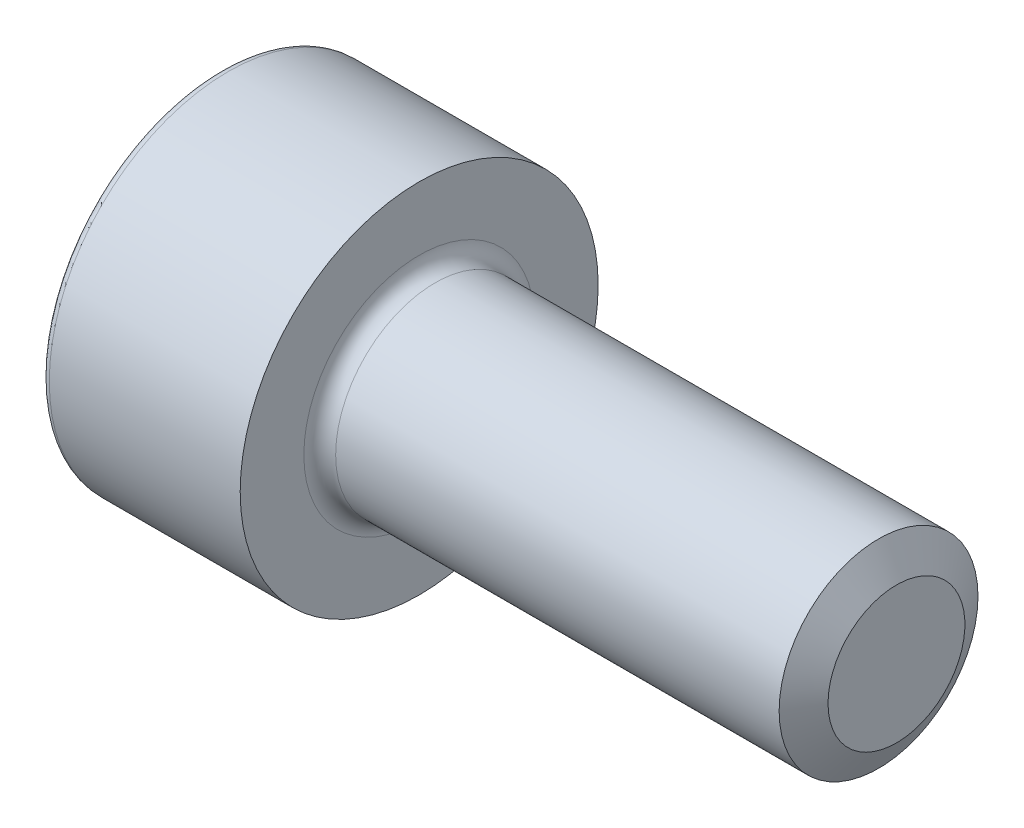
ISO-10303-21;
HEADER;
FILE_DESCRIPTION(('STEP AP214'),'2;1');
FILE_NAME('part.step','',(''),(''),'','','');
FILE_SCHEMA(('AUTOMOTIVE_DESIGN { 1 0 10303 214 1 1 1 1 }'));
ENDSEC;
DATA;
#1=APPLICATION_CONTEXT('core data for automotive mechanical design processes');
#2=APPLICATION_PROTOCOL_DEFINITION('international standard','automotive_design',2000,#1);
#3=PRODUCT_CONTEXT('',#1,'mechanical');
#4=PRODUCT('Part','Part','',(#3));
#5=PRODUCT_RELATED_PRODUCT_CATEGORY('part','',(#4));
#6=PRODUCT_DEFINITION_FORMATION('','',#4);
#7=PRODUCT_DEFINITION_CONTEXT('part definition',#1,'design');
#8=PRODUCT_DEFINITION('design','',#6,#7);
#9=PRODUCT_DEFINITION_SHAPE('','',#8);
#10=(LENGTH_UNIT() NAMED_UNIT(*) SI_UNIT(.MILLI.,.METRE.));
#11=(NAMED_UNIT(*) PLANE_ANGLE_UNIT() SI_UNIT($,.RADIAN.));
#12=(NAMED_UNIT(*) SI_UNIT($,.STERADIAN.) SOLID_ANGLE_UNIT());
#13=UNCERTAINTY_MEASURE_WITH_UNIT(LENGTH_MEASURE(1.E-05),#10,'distance_accuracy_value','');
#14=(GEOMETRIC_REPRESENTATION_CONTEXT(3) GLOBAL_UNCERTAINTY_ASSIGNED_CONTEXT((#13)) GLOBAL_UNIT_ASSIGNED_CONTEXT((#10,
#11,#12)) REPRESENTATION_CONTEXT('',''));
#15=CARTESIAN_POINT('',(0.,0.,0.));
#16=DIRECTION('',(0.,0.,1.));
#17=DIRECTION('',(1.,0.,0.));
#18=AXIS2_PLACEMENT_3D('',#15,#16,#17);
#19=CARTESIAN_POINT('',(8.5,1.25,0.));
#20=DIRECTION('',(-1.,0.,0.));
#21=DIRECTION('',(0.,0.,1.));
#22=AXIS2_PLACEMENT_3D('',#19,#20,#21);
#23=PLANE('',#22);
#24=CARTESIAN_POINT('',(8.5,0.,0.));
#25=DIRECTION('',(-1.,0.,0.));
#26=DIRECTION('',(0.,0.,1.));
#27=AXIS2_PLACEMENT_3D('',#24,#25,#26);
#28=CIRCLE('',#27,0.8603);
#29=CARTESIAN_POINT('',(8.5,0.,0.8603));
#30=VERTEX_POINT('',#29);
#31=EDGE_CURVE('E186',#30,#30,#28,.T.);
#32=ORIENTED_EDGE('',*,*,#31,.F.);
#33=EDGE_LOOP('',(#32));
#34=FACE_BOUND('',#33,.T.);
#35=ADVANCED_FACE('F17',(#34),#23,.F.);
#36=CARTESIAN_POINT('',(1.1,-0.995929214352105,0.575));
#37=DIRECTION('',(1.,0.,0.));
#38=DIRECTION('',(0.,1.,0.));
#39=AXIS2_PLACEMENT_3D('',#36,#37,#38);
#40=PLANE('',#39);
#41=DIRECTION('',(0.,0.866025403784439,0.5));
#42=VECTOR('',#41,1.);
#43=CARTESIAN_POINT('',(1.1,-0.995929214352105,0.575));
#44=LINE('',#43,#42);
#45=CARTESIAN_POINT('',(1.1,-0.995929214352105,0.575));
#46=VERTEX_POINT('',#45);
#47=CARTESIAN_POINT('',(1.1,0.,1.15));
#48=VERTEX_POINT('',#47);
#49=EDGE_CURVE('E93',#46,#48,#44,.T.);
#50=ORIENTED_EDGE('',*,*,#49,.T.);
#51=DIRECTION('',(0.,0.866025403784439,-0.5));
#52=VECTOR('',#51,1.);
#53=CARTESIAN_POINT('',(1.1,0.,1.15));
#54=LINE('',#53,#52);
#55=CARTESIAN_POINT('',(1.1,0.995929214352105,0.575));
#56=VERTEX_POINT('',#55);
#57=EDGE_CURVE('E11',#48,#56,#54,.T.);
#58=ORIENTED_EDGE('',*,*,#57,.T.);
#59=DIRECTION('',(0.,0.,-1.));
#60=VECTOR('',#59,1.);
#61=CARTESIAN_POINT('',(1.1,0.995929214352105,0.575));
#62=LINE('',#61,#60);
#63=CARTESIAN_POINT('',(1.1,0.995929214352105,-0.575));
#64=VERTEX_POINT('',#63);
#65=EDGE_CURVE('E45',#56,#64,#62,.T.);
#66=ORIENTED_EDGE('',*,*,#65,.T.);
#67=DIRECTION('',(0.,-0.866025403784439,-0.5));
#68=VECTOR('',#67,1.);
#69=CARTESIAN_POINT('',(1.1,0.995929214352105,-0.575));
#70=LINE('',#69,#68);
#71=CARTESIAN_POINT('',(1.1,0.,-1.15));
#72=VERTEX_POINT('',#71);
#73=EDGE_CURVE('E130',#64,#72,#70,.T.);
#74=ORIENTED_EDGE('',*,*,#73,.T.);
#75=DIRECTION('',(0.,-0.866025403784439,0.5));
#76=VECTOR('',#75,1.);
#77=CARTESIAN_POINT('',(1.1,0.,-1.15));
#78=LINE('',#77,#76);
#79=CARTESIAN_POINT('',(1.1,-0.995929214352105,-0.575));
#80=VERTEX_POINT('',#79);
#81=EDGE_CURVE('E125',#72,#80,#78,.T.);
#82=ORIENTED_EDGE('',*,*,#81,.T.);
#83=DIRECTION('',(0.,0.,1.));
#84=VECTOR('',#83,1.);
#85=CARTESIAN_POINT('',(1.1,-0.995929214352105,-0.575));
#86=LINE('',#85,#84);
#87=EDGE_CURVE('E96',#80,#46,#86,.T.);
#88=ORIENTED_EDGE('',*,*,#87,.T.);
#89=EDGE_LOOP('',(#50,#58,#66,#74,#82,#88));
#90=FACE_BOUND('',#89,.T.);
#91=ADVANCED_FACE('F94',(#90),#40,.F.);
#92=CARTESIAN_POINT('',(1.1,0.,1.15));
#93=DIRECTION('',(0.,0.5,0.866025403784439));
#94=DIRECTION('',(1.,0.,0.));
#95=AXIS2_PLACEMENT_3D('',#92,#93,#94);
#96=PLANE('',#95);
#97=DIRECTION('',(0.,0.866025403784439,-0.5));
#98=VECTOR('',#97,1.);
#99=CARTESIAN_POINT('',(0.,0.,1.15));
#100=LINE('',#99,#98);
#101=CARTESIAN_POINT('',(0.,0.,1.15));
#102=VERTEX_POINT('',#101);
#103=CARTESIAN_POINT('',(0.,0.995929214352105,0.575));
#104=VERTEX_POINT('',#103);
#105=EDGE_CURVE('E165',#102,#104,#100,.T.);
#106=ORIENTED_EDGE('',*,*,#105,.T.);
#107=DIRECTION('',(-1.,0.,0.));
#108=VECTOR('',#107,1.);
#109=CARTESIAN_POINT('',(1.1,0.995929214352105,0.575));
#110=LINE('',#109,#108);
#111=EDGE_CURVE('E20',#56,#104,#110,.T.);
#112=ORIENTED_EDGE('',*,*,#111,.F.);
#113=ORIENTED_EDGE('',*,*,#57,.F.);
#114=DIRECTION('',(-1.,0.,0.));
#115=VECTOR('',#114,1.);
#116=CARTESIAN_POINT('',(1.1,0.,1.15));
#117=LINE('',#116,#115);
#118=EDGE_CURVE('E90',#48,#102,#117,.T.);
#119=ORIENTED_EDGE('',*,*,#118,.T.);
#120=EDGE_LOOP('',(#106,#112,#113,#119));
#121=FACE_BOUND('',#120,.T.);
#122=ADVANCED_FACE('F88',(#121),#96,.F.);
#123=CARTESIAN_POINT('',(1.1,0.995929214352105,0.575));
#124=DIRECTION('',(0.,1.,0.));
#125=DIRECTION('',(0.,0.,-1.));
#126=AXIS2_PLACEMENT_3D('',#123,#124,#125);
#127=PLANE('',#126);
#128=DIRECTION('',(0.,0.,-1.));
#129=VECTOR('',#128,1.);
#130=CARTESIAN_POINT('',(0.,0.995929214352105,0.575));
#131=LINE('',#130,#129);
#132=CARTESIAN_POINT('',(0.,0.995929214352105,-0.575));
#133=VERTEX_POINT('',#132);
#134=EDGE_CURVE('E107',#104,#133,#131,.T.);
#135=ORIENTED_EDGE('',*,*,#134,.T.);
#136=DIRECTION('',(-1.,0.,0.));
#137=VECTOR('',#136,1.);
#138=CARTESIAN_POINT('',(1.1,0.995929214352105,-0.575));
#139=LINE('',#138,#137);
#140=EDGE_CURVE('E118',#64,#133,#139,.T.);
#141=ORIENTED_EDGE('',*,*,#140,.F.);
#142=ORIENTED_EDGE('',*,*,#65,.F.);
#143=ORIENTED_EDGE('',*,*,#111,.T.);
#144=EDGE_LOOP('',(#135,#141,#142,#143));
#145=FACE_BOUND('',#144,.T.);
#146=ADVANCED_FACE('F146',(#145),#127,.F.);
#147=CARTESIAN_POINT('',(1.1,0.995929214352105,-0.575));
#148=DIRECTION('',(0.,0.5,-0.866025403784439));
#149=DIRECTION('',(-1.,0.,0.));
#150=AXIS2_PLACEMENT_3D('',#147,#148,#149);
#151=PLANE('',#150);
#152=DIRECTION('',(0.,-0.866025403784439,-0.5));
#153=VECTOR('',#152,1.);
#154=CARTESIAN_POINT('',(0.,0.995929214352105,-0.575));
#155=LINE('',#154,#153);
#156=CARTESIAN_POINT('',(0.,0.,-1.15));
#157=VERTEX_POINT('',#156);
#158=EDGE_CURVE('E114',#133,#157,#155,.T.);
#159=ORIENTED_EDGE('',*,*,#158,.T.);
#160=DIRECTION('',(-1.,0.,0.));
#161=VECTOR('',#160,1.);
#162=CARTESIAN_POINT('',(1.1,0.,-1.15));
#163=LINE('',#162,#161);
#164=EDGE_CURVE('E128',#72,#157,#163,.T.);
#165=ORIENTED_EDGE('',*,*,#164,.F.);
#166=ORIENTED_EDGE('',*,*,#73,.F.);
#167=ORIENTED_EDGE('',*,*,#140,.T.);
#168=EDGE_LOOP('',(#159,#165,#166,#167));
#169=FACE_BOUND('',#168,.T.);
#170=ADVANCED_FACE('F140',(#169),#151,.F.);
#171=CARTESIAN_POINT('',(1.1,0.,-1.15));
#172=DIRECTION('',(0.,-0.5,-0.866025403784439));
#173=DIRECTION('',(0.,-0.866025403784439,0.5));
#174=AXIS2_PLACEMENT_3D('',#171,#172,#173);
#175=PLANE('',#174);
#176=DIRECTION('',(0.,-0.866025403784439,0.5));
#177=VECTOR('',#176,1.);
#178=CARTESIAN_POINT('',(0.,0.,-1.15));
#179=LINE('',#178,#177);
#180=CARTESIAN_POINT('',(0.,-0.995929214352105,-0.575));
#181=VERTEX_POINT('',#180);
#182=EDGE_CURVE('E152',#157,#181,#179,.T.);
#183=ORIENTED_EDGE('',*,*,#182,.T.);
#184=DIRECTION('',(-1.,0.,0.));
#185=VECTOR('',#184,1.);
#186=CARTESIAN_POINT('',(1.1,-0.995929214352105,-0.575));
#187=LINE('',#186,#185);
#188=EDGE_CURVE('E122',#80,#181,#187,.T.);
#189=ORIENTED_EDGE('',*,*,#188,.F.);
#190=ORIENTED_EDGE('',*,*,#81,.F.);
#191=ORIENTED_EDGE('',*,*,#164,.T.);
#192=EDGE_LOOP('',(#183,#189,#190,#191));
#193=FACE_BOUND('',#192,.T.);
#194=ADVANCED_FACE('F228',(#193),#175,.F.);
#195=CARTESIAN_POINT('',(1.1,-0.995929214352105,-0.575));
#196=DIRECTION('',(0.,-1.,0.));
#197=DIRECTION('',(0.,0.,-1.));
#198=AXIS2_PLACEMENT_3D('',#195,#196,#197);
#199=PLANE('',#198);
#200=DIRECTION('',(0.,0.,1.));
#201=VECTOR('',#200,1.);
#202=CARTESIAN_POINT('',(0.,-0.995929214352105,-0.575));
#203=LINE('',#202,#201);
#204=CARTESIAN_POINT('',(0.,-0.995929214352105,0.575));
#205=VERTEX_POINT('',#204);
#206=EDGE_CURVE('E157',#181,#205,#203,.T.);
#207=ORIENTED_EDGE('',*,*,#206,.T.);
#208=DIRECTION('',(-1.,0.,0.));
#209=VECTOR('',#208,1.);
#210=CARTESIAN_POINT('',(1.1,-0.995929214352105,0.575));
#211=LINE('',#210,#209);
#212=EDGE_CURVE('E100',#46,#205,#211,.T.);
#213=ORIENTED_EDGE('',*,*,#212,.F.);
#214=ORIENTED_EDGE('',*,*,#87,.F.);
#215=ORIENTED_EDGE('',*,*,#188,.T.);
#216=EDGE_LOOP('',(#207,#213,#214,#215));
#217=FACE_BOUND('',#216,.T.);
#218=ADVANCED_FACE('F231',(#217),#199,.F.);
#219=CARTESIAN_POINT('',(1.1,-0.995929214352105,0.575));
#220=DIRECTION('',(0.,-0.5,0.866025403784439));
#221=DIRECTION('',(-1.,0.,0.));
#222=AXIS2_PLACEMENT_3D('',#219,#220,#221);
#223=PLANE('',#222);
#224=DIRECTION('',(0.,0.866025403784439,0.5));
#225=VECTOR('',#224,1.);
#226=CARTESIAN_POINT('',(0.,-0.995929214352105,0.575));
#227=LINE('',#226,#225);
#228=EDGE_CURVE('E104',#205,#102,#227,.T.);
#229=ORIENTED_EDGE('',*,*,#228,.T.);
#230=ORIENTED_EDGE('',*,*,#118,.F.);
#231=ORIENTED_EDGE('',*,*,#49,.F.);
#232=ORIENTED_EDGE('',*,*,#212,.T.);
#233=EDGE_LOOP('',(#229,#230,#231,#232));
#234=FACE_BOUND('',#233,.T.);
#235=ADVANCED_FACE('F102',(#234),#223,.F.);
#236=CARTESIAN_POINT('',(2.5,2.25,0.));
#237=DIRECTION('',(-1.,0.,0.));
#238=DIRECTION('',(0.,0.,1.));
#239=AXIS2_PLACEMENT_3D('',#236,#237,#238);
#240=PLANE('',#239);
#241=CARTESIAN_POINT('',(2.5,0.,0.));
#242=DIRECTION('',(-1.,0.,0.));
#243=DIRECTION('',(0.,0.,1.));
#244=AXIS2_PLACEMENT_3D('',#241,#242,#243);
#245=CIRCLE('',#244,1.45);
#246=CARTESIAN_POINT('',(2.5,0.,1.45));
#247=VERTEX_POINT('',#246);
#248=EDGE_CURVE('E175',#247,#247,#245,.T.);
#249=ORIENTED_EDGE('',*,*,#248,.T.);
#250=EDGE_LOOP('',(#249));
#251=FACE_BOUND('',#250,.T.);
#252=CARTESIAN_POINT('',(2.5,0.,0.));
#253=DIRECTION('',(-1.,0.,0.));
#254=DIRECTION('',(0.,0.,1.));
#255=AXIS2_PLACEMENT_3D('',#252,#253,#254);
#256=CIRCLE('',#255,2.25);
#257=CARTESIAN_POINT('',(2.5,0.,2.25));
#258=VERTEX_POINT('',#257);
#259=EDGE_CURVE('E168',#258,#258,#256,.T.);
#260=ORIENTED_EDGE('',*,*,#259,.F.);
#261=EDGE_LOOP('',(#260));
#262=FACE_BOUND('',#261,.T.);
#263=ADVANCED_FACE('F238',(#251,#262),#240,.F.);
#264=CARTESIAN_POINT('',(0.,0.,0.));
#265=DIRECTION('',(1.,0.,0.));
#266=DIRECTION('',(0.,1.,0.));
#267=AXIS2_PLACEMENT_3D('',#264,#265,#266);
#268=PLANE('',#267);
#269=ORIENTED_EDGE('',*,*,#105,.F.);
#270=ORIENTED_EDGE('',*,*,#228,.F.);
#271=ORIENTED_EDGE('',*,*,#206,.F.);
#272=ORIENTED_EDGE('',*,*,#182,.F.);
#273=ORIENTED_EDGE('',*,*,#158,.F.);
#274=ORIENTED_EDGE('',*,*,#134,.F.);
#275=EDGE_LOOP('',(#269,#270,#271,#272,#273,#274));
#276=FACE_BOUND('',#275,.T.);
#277=CARTESIAN_POINT('',(0.,0.,0.));
#278=DIRECTION('',(-1.,0.,0.));
#279=DIRECTION('',(0.,0.,-1.));
#280=AXIS2_PLACEMENT_3D('',#277,#278,#279);
#281=CIRCLE('',#280,2.15);
#282=CARTESIAN_POINT('',(0.,0.,-2.15));
#283=VERTEX_POINT('',#282);
#284=EDGE_CURVE('E194',#283,#283,#281,.T.);
#285=ORIENTED_EDGE('',*,*,#284,.T.);
#286=EDGE_LOOP('',(#285));
#287=FACE_BOUND('',#286,.T.);
#288=ADVANCED_FACE('F148',(#276,#287),#268,.F.);
#289=CARTESIAN_POINT('',(0.,0.,0.));
#290=DIRECTION('',(-1.,0.,0.));
#291=DIRECTION('',(0.,0.,1.));
#292=AXIS2_PLACEMENT_3D('',#289,#290,#291);
#293=CYLINDRICAL_SURFACE('',#292,1.25);
#294=CARTESIAN_POINT('',(2.7,0.,0.));
#295=DIRECTION('',(-1.,0.,0.));
#296=DIRECTION('',(0.,0.,1.));
#297=AXIS2_PLACEMENT_3D('',#294,#295,#296);
#298=CIRCLE('',#297,1.25);
#299=CARTESIAN_POINT('',(2.7,0.,1.25));
#300=VERTEX_POINT('',#299);
#301=EDGE_CURVE('E171',#300,#300,#298,.T.);
#302=ORIENTED_EDGE('',*,*,#301,.F.);
#303=EDGE_LOOP('',(#302));
#304=FACE_BOUND('',#303,.T.);
#305=CARTESIAN_POINT('',(8.2750066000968,0.,0.));
#306=DIRECTION('',(-1.,0.,0.));
#307=DIRECTION('',(0.,0.,1.));
#308=AXIS2_PLACEMENT_3D('',#305,#306,#307);
#309=CIRCLE('',#308,1.25);
#310=CARTESIAN_POINT('',(8.2750066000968,0.,1.25));
#311=VERTEX_POINT('',#310);
#312=EDGE_CURVE('E179',#311,#311,#309,.T.);
#313=ORIENTED_EDGE('',*,*,#312,.T.);
#314=EDGE_LOOP('',(#313));
#315=FACE_BOUND('',#314,.T.);
#316=ADVANCED_FACE('F244',(#304,#315),#293,.T.);
#317=CARTESIAN_POINT('',(0.,0.,0.));
#318=DIRECTION('',(-1.,0.,0.));
#319=DIRECTION('',(0.,0.,1.));
#320=AXIS2_PLACEMENT_3D('',#317,#318,#319);
#321=CYLINDRICAL_SURFACE('',#320,2.25);
#322=CARTESIAN_POINT('',(0.1,0.,0.));
#323=DIRECTION('',(1.,0.,0.));
#324=DIRECTION('',(0.,0.,-1.));
#325=AXIS2_PLACEMENT_3D('',#322,#323,#324);
#326=CIRCLE('',#325,2.25);
#327=CARTESIAN_POINT('',(0.1,0.,-2.25));
#328=VERTEX_POINT('',#327);
#329=EDGE_CURVE('E190',#328,#328,#326,.T.);
#330=ORIENTED_EDGE('',*,*,#329,.T.);
#331=EDGE_LOOP('',(#330));
#332=FACE_BOUND('',#331,.T.);
#333=ORIENTED_EDGE('',*,*,#259,.T.);
#334=EDGE_LOOP('',(#333));
#335=FACE_BOUND('',#334,.T.);
#336=ADVANCED_FACE('F247',(#332,#335),#321,.T.);
#337=CARTESIAN_POINT('',(2.7,0.,0.));
#338=DIRECTION('',(-1.,0.,0.));
#339=DIRECTION('',(0.,0.,1.));
#340=AXIS2_PLACEMENT_3D('',#337,#338,#339);
#341=TOROIDAL_SURFACE('',#340,1.45,0.2);
#342=ORIENTED_EDGE('',*,*,#301,.T.);
#343=EDGE_LOOP('',(#342));
#344=FACE_BOUND('',#343,.T.);
#345=ORIENTED_EDGE('',*,*,#248,.F.);
#346=EDGE_LOOP('',(#345));
#347=FACE_BOUND('',#346,.T.);
#348=ADVANCED_FACE('F210',(#344,#347),#341,.F.);
#349=CARTESIAN_POINT('',(8.2750066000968,0.,0.));
#350=DIRECTION('',(-1.,0.,0.));
#351=DIRECTION('',(0.,0.,1.));
#352=AXIS2_PLACEMENT_3D('',#349,#350,#351);
#353=CONICAL_SURFACE('',#352,1.25,1.0471975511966);
#354=ORIENTED_EDGE('',*,*,#312,.F.);
#355=EDGE_LOOP('',(#354));
#356=FACE_BOUND('',#355,.T.);
#357=ORIENTED_EDGE('',*,*,#31,.T.);
#358=EDGE_LOOP('',(#357));
#359=FACE_BOUND('',#358,.T.);
#360=ADVANCED_FACE('F203',(#356,#359),#353,.T.);
#361=CARTESIAN_POINT('',(0.1,0.,0.));
#362=DIRECTION('',(1.,0.,0.));
#363=DIRECTION('',(0.,0.,-1.));
#364=AXIS2_PLACEMENT_3D('',#361,#362,#363);
#365=TOROIDAL_SURFACE('',#364,2.15,0.1);
#366=ORIENTED_EDGE('',*,*,#329,.F.);
#367=EDGE_LOOP('',(#366));
#368=FACE_BOUND('',#367,.T.);
#369=ORIENTED_EDGE('',*,*,#284,.F.);
#370=EDGE_LOOP('',(#369));
#371=FACE_BOUND('',#370,.T.);
#372=ADVANCED_FACE('F201',(#368,#371),#365,.T.);
#373=CLOSED_SHELL('',(#35,#91,#122,#146,#170,#194,#218,#235,#263,#288,#316,#336,#348,#360,#372));
#374=MANIFOLD_SOLID_BREP('B1',#373);
#375=ADVANCED_BREP_SHAPE_REPRESENTATION('',(#18,#374),#14);
#376=SHAPE_DEFINITION_REPRESENTATION(#9,#375);
ENDSEC;
END-ISO-10303-21;
